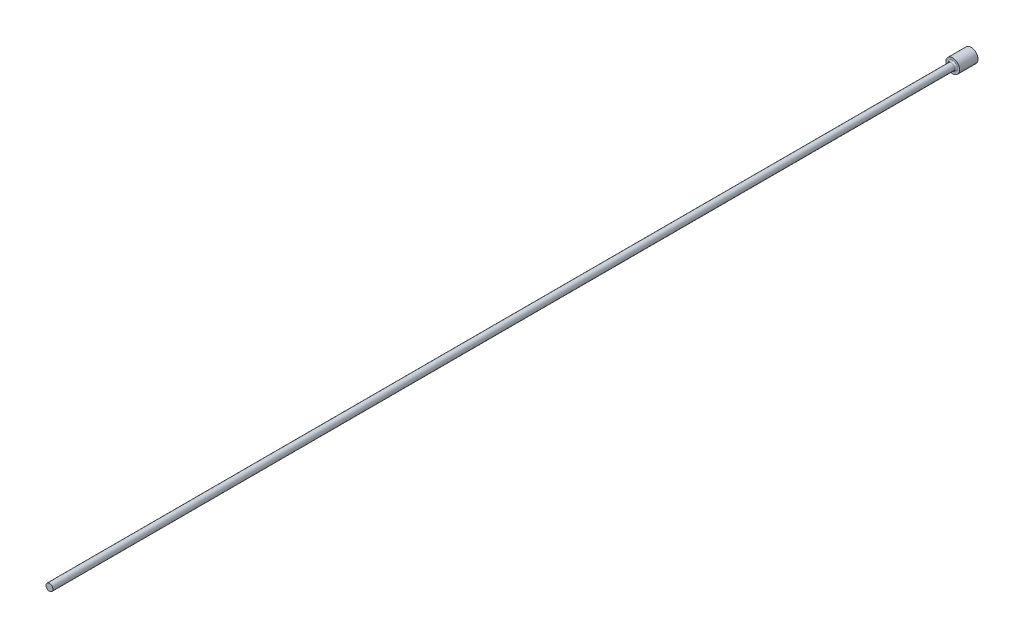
ISO-10303-21;
HEADER;
FILE_DESCRIPTION(('STEP AP214'),'2;1');
FILE_NAME('part.step','',(''),(''),'','','');
FILE_SCHEMA(('AUTOMOTIVE_DESIGN { 1 0 10303 214 1 1 1 1 }'));
ENDSEC;
DATA;
#1=APPLICATION_CONTEXT('core data for automotive mechanical design processes');
#2=APPLICATION_PROTOCOL_DEFINITION('international standard','automotive_design',2000,#1);
#3=PRODUCT_CONTEXT('',#1,'mechanical');
#4=PRODUCT('Part','Part','',(#3));
#5=PRODUCT_RELATED_PRODUCT_CATEGORY('part','',(#4));
#6=PRODUCT_DEFINITION_FORMATION('','',#4);
#7=PRODUCT_DEFINITION_CONTEXT('part definition',#1,'design');
#8=PRODUCT_DEFINITION('design','',#6,#7);
#9=PRODUCT_DEFINITION_SHAPE('','',#8);
#10=(LENGTH_UNIT() NAMED_UNIT(*) SI_UNIT(.MILLI.,.METRE.));
#11=(NAMED_UNIT(*) PLANE_ANGLE_UNIT() SI_UNIT($,.RADIAN.));
#12=(NAMED_UNIT(*) SI_UNIT($,.STERADIAN.) SOLID_ANGLE_UNIT());
#13=UNCERTAINTY_MEASURE_WITH_UNIT(LENGTH_MEASURE(1.E-05),#10,'distance_accuracy_value','');
#14=(GEOMETRIC_REPRESENTATION_CONTEXT(3) GLOBAL_UNCERTAINTY_ASSIGNED_CONTEXT((#13)) GLOBAL_UNIT_ASSIGNED_CONTEXT((#10,
#11,#12)) REPRESENTATION_CONTEXT('',''));
#15=CARTESIAN_POINT('',(0.,0.,0.));
#16=DIRECTION('',(0.,0.,1.));
#17=DIRECTION('',(1.,0.,0.));
#18=AXIS2_PLACEMENT_3D('',#15,#16,#17);
#19=CARTESIAN_POINT('',(1.5,0.,4.));
#20=DIRECTION('',(0.,0.,-1.));
#21=DIRECTION('',(-1.,0.,0.));
#22=AXIS2_PLACEMENT_3D('',#19,#20,#21);
#23=PLANE('',#22);
#24=CARTESIAN_POINT('',(0.,0.,4.));
#25=DIRECTION('',(0.,0.,-1.));
#26=DIRECTION('',(-1.,0.,0.));
#27=AXIS2_PLACEMENT_3D('',#24,#25,#26);
#28=CIRCLE('',#27,1.05000000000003);
#29=CARTESIAN_POINT('',(-1.05000000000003,0.,4.));
#30=VERTEX_POINT('',#29);
#31=EDGE_CURVE('E40',#30,#30,#28,.T.);
#32=ORIENTED_EDGE('',*,*,#31,.T.);
#33=EDGE_LOOP('',(#32));
#34=FACE_BOUND('',#33,.T.);
#35=CARTESIAN_POINT('',(0.,0.,4.));
#36=DIRECTION('',(0.,0.,-1.));
#37=DIRECTION('',(-1.,0.,0.));
#38=AXIS2_PLACEMENT_3D('',#35,#36,#37);
#39=CIRCLE('',#38,1.5);
#40=CARTESIAN_POINT('',(-1.5,0.,4.));
#41=VERTEX_POINT('',#40);
#42=EDGE_CURVE('E44',#41,#41,#39,.T.);
#43=ORIENTED_EDGE('',*,*,#42,.F.);
#44=EDGE_LOOP('',(#43));
#45=FACE_BOUND('',#44,.T.);
#46=ADVANCED_FACE('F33',(#34,#45),#23,.F.);
#47=CARTESIAN_POINT('',(0.,0.,-9.03322817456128));
#48=DIRECTION('',(0.,0.,-1.));
#49=DIRECTION('',(-1.,0.,0.));
#50=AXIS2_PLACEMENT_3D('',#47,#48,#49);
#51=CYLINDRICAL_SURFACE('',#50,1.5);
#52=CARTESIAN_POINT('',(0.,0.,0.));
#53=DIRECTION('',(0.,0.,-1.));
#54=DIRECTION('',(-1.,0.,0.));
#55=AXIS2_PLACEMENT_3D('',#52,#53,#54);
#56=CIRCLE('',#55,1.5);
#57=CARTESIAN_POINT('',(-1.5,0.,0.));
#58=VERTEX_POINT('',#57);
#59=EDGE_CURVE('E48',#58,#58,#56,.T.);
#60=ORIENTED_EDGE('',*,*,#59,.F.);
#61=EDGE_LOOP('',(#60));
#62=FACE_BOUND('',#61,.T.);
#63=ORIENTED_EDGE('',*,*,#42,.T.);
#64=EDGE_LOOP('',(#63));
#65=FACE_BOUND('',#64,.T.);
#66=ADVANCED_FACE('F68',(#62,#65),#51,.T.);
#67=CARTESIAN_POINT('',(0.,0.,0.));
#68=DIRECTION('',(0.,0.,1.));
#69=DIRECTION('',(1.,0.,0.));
#70=AXIS2_PLACEMENT_3D('',#67,#68,#69);
#71=PLANE('',#70);
#72=ORIENTED_EDGE('',*,*,#59,.T.);
#73=EDGE_LOOP('',(#72));
#74=FACE_BOUND('',#73,.T.);
#75=ADVANCED_FACE('F61',(#74),#71,.F.);
#76=CARTESIAN_POINT('',(0.,0.,200.));
#77=DIRECTION('',(0.,0.,-1.));
#78=DIRECTION('',(-1.,0.,0.));
#79=AXIS2_PLACEMENT_3D('',#76,#77,#78);
#80=PLANE('',#79);
#81=CARTESIAN_POINT('',(0.,0.,200.));
#82=DIRECTION('',(0.,0.,-1.));
#83=DIRECTION('',(-1.,0.,0.));
#84=AXIS2_PLACEMENT_3D('',#81,#82,#83);
#85=CIRCLE('',#84,0.750000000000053);
#86=CARTESIAN_POINT('',(-0.750000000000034,0.,200.));
#87=VERTEX_POINT('',#86);
#88=EDGE_CURVE('E53',#87,#87,#85,.T.);
#89=ORIENTED_EDGE('',*,*,#88,.F.);
#90=EDGE_LOOP('',(#89));
#91=FACE_BOUND('',#90,.T.);
#92=ADVANCED_FACE('F59',(#91),#80,.F.);
#93=CARTESIAN_POINT('',(0.,0.,-9.03322817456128));
#94=DIRECTION('',(0.,0.,-1.));
#95=DIRECTION('',(-1.,0.,0.));
#96=AXIS2_PLACEMENT_3D('',#93,#94,#95);
#97=CYLINDRICAL_SURFACE('',#96,0.750000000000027);
#98=CARTESIAN_POINT('',(0.,0.,4.3));
#99=DIRECTION('',(0.,0.,-1.));
#100=DIRECTION('',(-1.,0.,0.));
#101=AXIS2_PLACEMENT_3D('',#98,#99,#100);
#102=CIRCLE('',#101,0.750000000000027);
#103=CARTESIAN_POINT('',(-0.750000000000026,0.,4.3));
#104=VERTEX_POINT('',#103);
#105=EDGE_CURVE('E10',#104,#104,#102,.F.);
#106=ORIENTED_EDGE('',*,*,#105,.T.);
#107=EDGE_LOOP('',(#106));
#108=FACE_BOUND('',#107,.T.);
#109=ORIENTED_EDGE('',*,*,#88,.T.);
#110=EDGE_LOOP('',(#109));
#111=FACE_BOUND('',#110,.T.);
#112=ADVANCED_FACE('F57',(#108,#111),#97,.T.);
#113=CARTESIAN_POINT('',(0.,0.,4.3));
#114=DIRECTION('',(0.,0.,-1.));
#115=DIRECTION('',(-1.,0.,0.));
#116=AXIS2_PLACEMENT_3D('',#113,#114,#115);
#117=TOROIDAL_SURFACE('',#116,1.05000000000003,0.3);
#118=ORIENTED_EDGE('',*,*,#105,.F.);
#119=EDGE_LOOP('',(#118));
#120=FACE_BOUND('',#119,.T.);
#121=ORIENTED_EDGE('',*,*,#31,.F.);
#122=EDGE_LOOP('',(#121));
#123=FACE_BOUND('',#122,.T.);
#124=ADVANCED_FACE('F35',(#120,#123),#117,.F.);
#125=CLOSED_SHELL('',(#46,#66,#75,#92,#112,#124));
#126=MANIFOLD_SOLID_BREP('B2',#125);
#127=ADVANCED_BREP_SHAPE_REPRESENTATION('',(#18,#126),#14);
#128=SHAPE_DEFINITION_REPRESENTATION(#9,#127);
ENDSEC;
END-ISO-10303-21;
